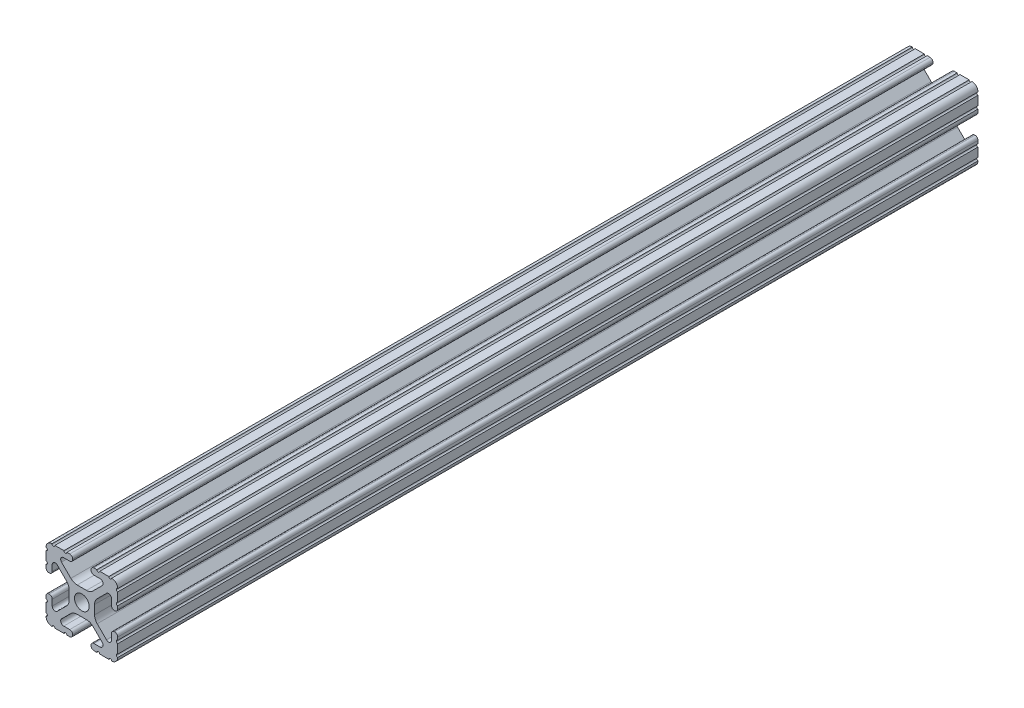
from build123d import *

# Parameters (mm, degrees)
SKETCH1_R      = 2.6035
EXTRUDE1_DEPTH = 304.8


with BuildPart() as part:
    # Sketch1 → Extrude1 (new body)
    with BuildSketch(Plane.XY):
        with BuildLine():
            Line((-7.207036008, 8.724370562), (-3.898272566, 5.423169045))
            ThreePointArc((-3.898272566, 5.423169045), (-2.869120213, 4.736787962), (-1.655778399, 4.4958))
            Line((-1.655778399, 4.4958), (1.655778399, 4.4958))
            ThreePointArc((1.655778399, 4.4958), (2.869120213, 4.736787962), (3.898272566, 5.423169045))
            Line((3.898272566, 5.423169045), (7.207036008, 8.724370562))
            ThreePointArc((7.207036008, 8.724370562), (7.432222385, 9.85140422), (6.476788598, 10.4902))
            Line((6.476788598, 10.4902), (4.287512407, 10.4902))
            ThreePointArc((4.287512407, 10.4902), (3.54574862, 10.79744862), (3.2385, 11.539212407))
            Line((3.2385, 11.539212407), (3.2385, 11.650987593))
            ThreePointArc((3.2385, 11.650987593), (3.54574862, 12.39275138), (4.287512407, 12.7))
            Line((4.287512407, 12.7), (5.317126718, 12.7))
            ThreePointArc((5.317126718, 12.7), (5.825126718, 12.192), (6.333126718, 12.7))
            Line((6.333126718, 12.7), (9.550443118, 12.7))
            ThreePointArc((9.550443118, 12.7), (10.058366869, 12.192000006), (10.566443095, 12.699847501))
            ThreePointArc((10.566443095, 12.699847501), (12.082537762, 12.08250727), (12.699846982, 10.566399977))
            ThreePointArc((12.699846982, 10.566399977), (12.192000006, 10.058323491), (12.7, 9.5504))
            Line((12.7, 9.5504), (12.7, 6.3330836))
            ThreePointArc((12.7, 6.3330836), (12.192, 5.8250836), (12.7, 5.3170836))
            Line((12.7, 5.3170836), (12.7, 4.287469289))
            ThreePointArc((12.7, 4.287469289), (12.39275138, 3.545705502), (11.650987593, 3.238456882))
            Line((11.650987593, 3.238456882), (11.539212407, 3.238456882))
            ThreePointArc((11.539212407, 3.238456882), (10.79744862, 3.545705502), (10.4902, 4.287469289))
            Line((10.4902, 4.287469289), (10.4902, 6.402089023))
            ThreePointArc((10.4902, 6.402089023), (9.856505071, 7.351067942), (8.737131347, 7.129408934))
            Line((8.737131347, 7.129408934), (5.441005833, 3.840816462))
            ThreePointArc((5.441005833, 3.840816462), (4.750877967, 2.809883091), (4.5085, 1.593185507))
            Line((4.5085, 1.593185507), (4.5085, -1.593185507))
            ThreePointArc((4.5085, -1.593185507), (4.750877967, -2.809883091), (5.441005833, -3.840816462))
            Line((5.441005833, -3.840816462), (8.737131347, -7.129408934))
            ThreePointArc((8.737131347, -7.129408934), (9.856505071, -7.351067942), (10.4902, -6.402089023))
            Line((10.4902, -6.402089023), (10.4902, -4.287469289))
            ThreePointArc((10.4902, -4.287469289), (10.79744862, -3.545705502), (11.539212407, -3.238456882))
            Line((11.539212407, -3.238456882), (11.650987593, -3.238456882))
            ThreePointArc((11.650987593, -3.238456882), (12.39275138, -3.545705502), (12.7, -4.287469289))
            Line((12.7, -4.287469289), (12.7, -5.3170836))
            ThreePointArc((12.7, -5.3170836), (12.192, -5.8250836), (12.7, -6.3330836))
            Line((12.7, -6.3330836), (12.7, -9.5504))
            ThreePointArc((12.7, -9.5504), (12.192000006, -10.058323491), (12.699846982, -10.566399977))
            ThreePointArc((12.699846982, -10.566399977), (12.082537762, -12.08250727), (10.566443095, -12.699847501))
            ThreePointArc((10.566443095, -12.699847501), (10.058366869, -12.192000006), (9.550443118, -12.7))
            Line((9.550443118, -12.7), (6.333126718, -12.7))
            ThreePointArc((6.333126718, -12.7), (5.825126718, -12.192), (5.317126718, -12.7))
            Line((5.317126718, -12.7), (4.287512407, -12.7))
            ThreePointArc((4.287512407, -12.7), (3.54574862, -12.39275138), (3.2385, -11.650987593))
            Line((3.2385, -11.650987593), (3.2385, -11.539212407))
            ThreePointArc((3.2385, -11.539212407), (3.54574862, -10.79744862), (4.287512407, -10.4902))
            Line((4.287512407, -10.4902), (6.416408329, -10.4902))
            ThreePointArc((6.416408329, -10.4902), (7.41473083, -9.822813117), (7.179650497, -8.645192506))
            Line((7.179650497, -8.645192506), (3.952270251, -5.423690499))
            ThreePointArc((3.952270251, -5.423690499), (2.922936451, -4.736929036), (1.709253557, -4.4958))
            Line((1.709253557, -4.4958), (-1.709253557, -4.4958))
            ThreePointArc((-1.709253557, -4.4958), (-2.922936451, -4.736929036), (-3.952270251, -5.423690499))
            Line((-3.952270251, -5.423690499), (-7.179650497, -8.645192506))
            ThreePointArc((-7.179650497, -8.645192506), (-7.41473083, -9.822813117), (-6.416408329, -10.4902))
            Line((-6.416408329, -10.4902), (-4.287512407, -10.4902))
            ThreePointArc((-4.287512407, -10.4902), (-3.54574862, -10.79744862), (-3.2385, -11.539212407))
            Line((-3.2385, -11.539212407), (-3.2385, -11.650987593))
            ThreePointArc((-3.2385, -11.650987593), (-3.54574862, -12.39275138), (-4.287512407, -12.7))
            Line((-4.287512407, -12.7), (-5.317126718, -12.7))
            ThreePointArc((-5.317126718, -12.7), (-5.825126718, -12.192), (-6.333126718, -12.7))
            Line((-6.333126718, -12.7), (-9.550443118, -12.7))
            ThreePointArc((-9.550443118, -12.7), (-10.058366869, -12.192000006), (-10.566443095, -12.699847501))
            ThreePointArc((-10.566443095, -12.699847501), (-12.082537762, -12.08250727), (-12.699846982, -10.566399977))
            ThreePointArc((-12.699846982, -10.566399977), (-12.192000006, -10.058323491), (-12.7, -9.5504))
            Line((-12.7, -9.5504), (-12.7, -6.3330836))
            ThreePointArc((-12.7, -6.3330836), (-12.192, -5.8250836), (-12.7, -5.3170836))
            Line((-12.7, -5.3170836), (-12.7, -4.287469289))
            ThreePointArc((-12.7, -4.287469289), (-12.39275138, -3.545705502), (-11.650987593, -3.238456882))
            Line((-11.650987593, -3.238456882), (-11.539212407, -3.238456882))
            ThreePointArc((-11.539212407, -3.238456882), (-10.79744862, -3.545705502), (-10.4902, -4.287469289))
            Line((-10.4902, -4.287469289), (-10.4902, -6.402089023))
            ThreePointArc((-10.4902, -6.402089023), (-9.856505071, -7.351067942), (-8.737131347, -7.129408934))
            Line((-8.737131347, -7.129408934), (-5.441005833, -3.840816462))
            ThreePointArc((-5.441005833, -3.840816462), (-4.750877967, -2.809883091), (-4.5085, -1.593185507))
            Line((-4.5085, -1.593185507), (-4.5085, 1.593185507))
            ThreePointArc((-4.5085, 1.593185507), (-4.750877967, 2.809883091), (-5.441005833, 3.840816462))
            Line((-5.441005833, 3.840816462), (-8.737131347, 7.129408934))
            ThreePointArc((-8.737131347, 7.129408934), (-9.856505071, 7.351067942), (-10.4902, 6.402089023))
            Line((-10.4902, 6.402089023), (-10.4902, 4.287469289))
            ThreePointArc((-10.4902, 4.287469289), (-10.79744862, 3.545705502), (-11.539212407, 3.238456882))
            Line((-11.539212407, 3.238456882), (-11.650987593, 3.238456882))
            ThreePointArc((-11.650987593, 3.238456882), (-12.39275138, 3.545705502), (-12.7, 4.287469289))
            Line((-12.7, 4.287469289), (-12.7, 5.3170836))
            ThreePointArc((-12.7, 5.3170836), (-12.192, 5.8250836), (-12.7, 6.3330836))
            Line((-12.7, 6.3330836), (-12.7, 9.5504))
            ThreePointArc((-12.7, 9.5504), (-12.192000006, 10.058323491), (-12.699846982, 10.566399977))
            ThreePointArc((-12.699846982, 10.566399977), (-12.082537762, 12.08250727), (-10.566443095, 12.699847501))
            ThreePointArc((-10.566443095, 12.699847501), (-10.058366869, 12.192000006), (-9.550443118, 12.7))
            Line((-9.550443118, 12.7), (-6.333126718, 12.7))
            ThreePointArc((-6.333126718, 12.7), (-5.825126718, 12.192), (-5.317126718, 12.7))
            Line((-5.317126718, 12.7), (-4.287512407, 12.7))
            ThreePointArc((-4.287512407, 12.7), (-3.54574862, 12.39275138), (-3.2385, 11.650987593))
            Line((-3.2385, 11.650987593), (-3.2385, 11.539212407))
            ThreePointArc((-3.2385, 11.539212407), (-3.54574862, 10.79744862), (-4.287512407, 10.4902))
            Line((-4.287512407, 10.4902), (-6.476788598, 10.4902))
            ThreePointArc((-6.476788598, 10.4902), (-7.432222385, 9.85140422), (-7.207036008, 8.724370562))
        make_face()
        Circle(SKETCH1_R, mode=Mode.SUBTRACT)
    extrude(amount=-EXTRUDE1_DEPTH)


solid = part.part
